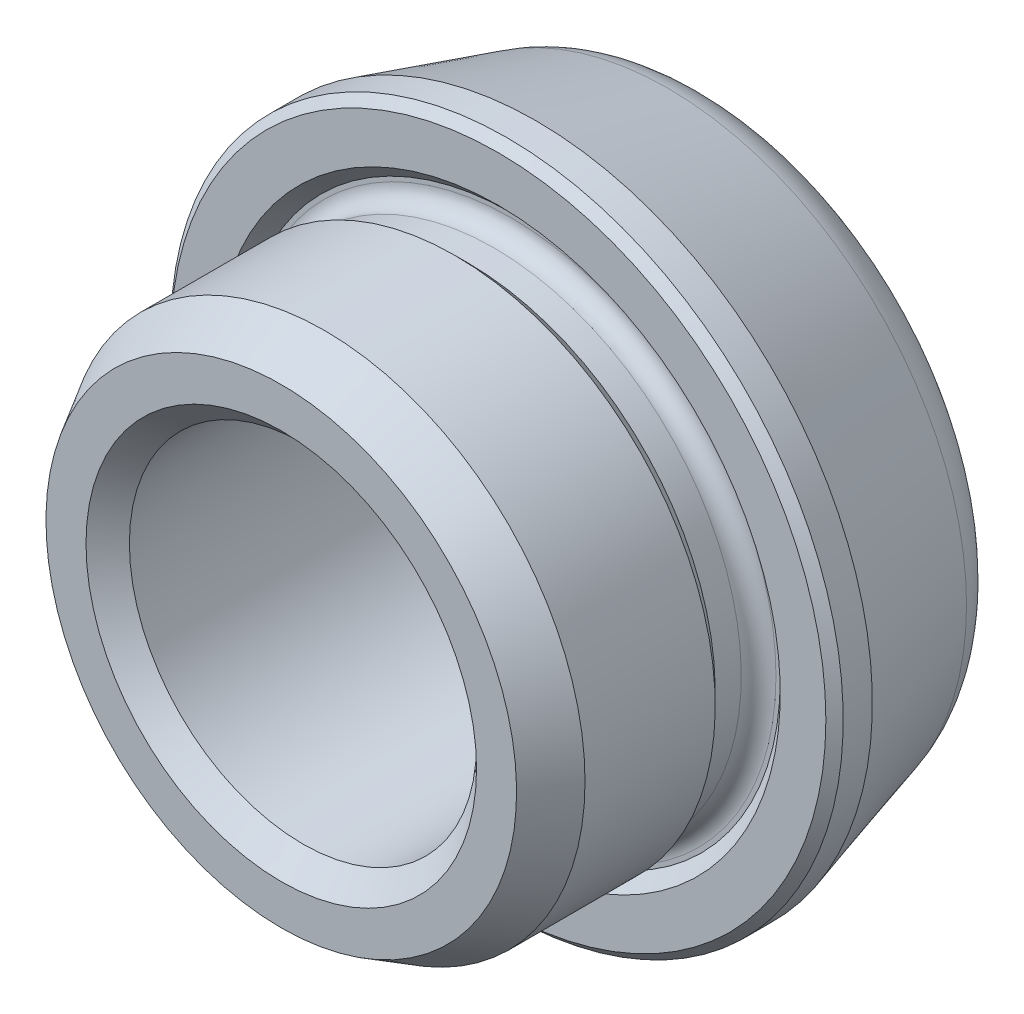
ISO-10303-21;
HEADER;
FILE_DESCRIPTION(('STEP AP214'),'2;1');
FILE_NAME('part.step','',(''),(''),'','','');
FILE_SCHEMA(('AUTOMOTIVE_DESIGN { 1 0 10303 214 1 1 1 1 }'));
ENDSEC;
DATA;
#1=APPLICATION_CONTEXT('core data for automotive mechanical design processes');
#2=APPLICATION_PROTOCOL_DEFINITION('international standard','automotive_design',2000,#1);
#3=PRODUCT_CONTEXT('',#1,'mechanical');
#4=PRODUCT('Part','Part','',(#3));
#5=PRODUCT_RELATED_PRODUCT_CATEGORY('part','',(#4));
#6=PRODUCT_DEFINITION_FORMATION('','',#4);
#7=PRODUCT_DEFINITION_CONTEXT('part definition',#1,'design');
#8=PRODUCT_DEFINITION('design','',#6,#7);
#9=PRODUCT_DEFINITION_SHAPE('','',#8);
#10=(LENGTH_UNIT() NAMED_UNIT(*) SI_UNIT(.MILLI.,.METRE.));
#11=(NAMED_UNIT(*) PLANE_ANGLE_UNIT() SI_UNIT($,.RADIAN.));
#12=(NAMED_UNIT(*) SI_UNIT($,.STERADIAN.) SOLID_ANGLE_UNIT());
#13=UNCERTAINTY_MEASURE_WITH_UNIT(LENGTH_MEASURE(1.E-05),#10,'distance_accuracy_value','');
#14=(GEOMETRIC_REPRESENTATION_CONTEXT(3) GLOBAL_UNCERTAINTY_ASSIGNED_CONTEXT((#13)) GLOBAL_UNIT_ASSIGNED_CONTEXT((#10,
#11,#12)) REPRESENTATION_CONTEXT('',''));
#15=CARTESIAN_POINT('',(0.,0.,0.));
#16=DIRECTION('',(0.,0.,1.));
#17=DIRECTION('',(1.,0.,0.));
#18=AXIS2_PLACEMENT_3D('',#15,#16,#17);
#19=CARTESIAN_POINT('',(0.,0.,0.));
#20=DIRECTION('',(0.,0.,-1.));
#21=DIRECTION('',(0.,1.,0.));
#22=AXIS2_PLACEMENT_3D('',#19,#20,#21);
#23=CYLINDRICAL_SURFACE('',#22,6.);
#24=CARTESIAN_POINT('',(0.,0.,1.));
#25=DIRECTION('',(0.,0.,-1.));
#26=DIRECTION('',(0.,1.,0.));
#27=AXIS2_PLACEMENT_3D('',#24,#25,#26);
#28=CIRCLE('',#27,6.);
#29=CARTESIAN_POINT('',(0.,6.,1.));
#30=VERTEX_POINT('',#29);
#31=EDGE_CURVE('E62',#30,#30,#28,.T.);
#32=ORIENTED_EDGE('',*,*,#31,.F.);
#33=EDGE_LOOP('',(#32));
#34=FACE_BOUND('',#33,.T.);
#35=CARTESIAN_POINT('',(0.,0.,4.));
#36=DIRECTION('',(0.,0.,1.));
#37=DIRECTION('',(0.,-1.,0.));
#38=AXIS2_PLACEMENT_3D('',#35,#36,#37);
#39=CIRCLE('',#38,6.);
#40=CARTESIAN_POINT('',(0.,-6.,4.));
#41=VERTEX_POINT('',#40);
#42=EDGE_CURVE('E47',#41,#41,#39,.F.);
#43=ORIENTED_EDGE('',*,*,#42,.T.);
#44=EDGE_LOOP('',(#43));
#45=FACE_BOUND('',#44,.T.);
#46=ADVANCED_FACE('F12',(#34,#45),#23,.T.);
#47=CARTESIAN_POINT('',(6.,0.,0.));
#48=DIRECTION('',(0.,0.,1.));
#49=DIRECTION('',(0.,-1.,0.));
#50=AXIS2_PLACEMENT_3D('',#47,#48,#49);
#51=PLANE('',#50);
#52=CARTESIAN_POINT('',(0.,0.,0.));
#53=DIRECTION('',(0.,0.,-1.));
#54=DIRECTION('',(0.,1.,0.));
#55=AXIS2_PLACEMENT_3D('',#52,#53,#54);
#56=CIRCLE('',#55,6.5);
#57=CARTESIAN_POINT('',(0.,6.5,0.));
#58=VERTEX_POINT('',#57);
#59=EDGE_CURVE('E59',#58,#58,#56,.T.);
#60=ORIENTED_EDGE('',*,*,#59,.T.);
#61=EDGE_LOOP('',(#60));
#62=FACE_BOUND('',#61,.T.);
#63=CARTESIAN_POINT('',(0.,0.,0.));
#64=DIRECTION('',(0.,0.,1.));
#65=DIRECTION('',(0.,-1.,0.));
#66=AXIS2_PLACEMENT_3D('',#63,#64,#65);
#67=CIRCLE('',#66,7.55);
#68=CARTESIAN_POINT('',(0.,-7.55,0.));
#69=VERTEX_POINT('',#68);
#70=EDGE_CURVE('E23',#69,#69,#67,.T.);
#71=ORIENTED_EDGE('',*,*,#70,.T.);
#72=EDGE_LOOP('',(#71));
#73=FACE_BOUND('',#72,.T.);
#74=ADVANCED_FACE('F87',(#62,#73),#51,.T.);
#75=CARTESIAN_POINT('',(0.,0.,0.));
#76=DIRECTION('',(0.,0.,-1.));
#77=DIRECTION('',(0.,1.,0.));
#78=AXIS2_PLACEMENT_3D('',#75,#76,#77);
#79=CYLINDRICAL_SURFACE('',#78,7.75);
#80=CARTESIAN_POINT('',(0.,0.,-0.199999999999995));
#81=DIRECTION('',(0.,0.,1.));
#82=DIRECTION('',(0.,-1.,0.));
#83=AXIS2_PLACEMENT_3D('',#80,#81,#82);
#84=CIRCLE('',#83,7.75);
#85=CARTESIAN_POINT('',(0.,-7.75,-0.199999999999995));
#86=VERTEX_POINT('',#85);
#87=EDGE_CURVE('E27',#86,#86,#84,.F.);
#88=ORIENTED_EDGE('',*,*,#87,.T.);
#89=EDGE_LOOP('',(#88));
#90=FACE_BOUND('',#89,.T.);
#91=CARTESIAN_POINT('',(0.,0.,-0.871853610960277));
#92=DIRECTION('',(0.,0.,-1.));
#93=DIRECTION('',(0.,1.,0.));
#94=AXIS2_PLACEMENT_3D('',#91,#92,#93);
#95=CIRCLE('',#94,7.75);
#96=CARTESIAN_POINT('',(0.,7.75,-0.871853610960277));
#97=VERTEX_POINT('',#96);
#98=EDGE_CURVE('E56',#97,#97,#95,.T.);
#99=ORIENTED_EDGE('',*,*,#98,.F.);
#100=EDGE_LOOP('',(#99));
#101=FACE_BOUND('',#100,.T.);
#102=ADVANCED_FACE('F93',(#90,#101),#79,.T.);
#103=CARTESIAN_POINT('',(0.,0.,-5.));
#104=DIRECTION('',(0.,0.,1.));
#105=DIRECTION('',(0.,-1.,0.));
#106=AXIS2_PLACEMENT_3D('',#103,#104,#105);
#107=CONICAL_SURFACE('',#106,6.56627307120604,0.279252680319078);
#108=CARTESIAN_POINT('',(0.,0.,-3.91345603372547));
#109=DIRECTION('',(0.,0.,-1.));
#110=DIRECTION('',(0.,1.,0.));
#111=AXIS2_PLACEMENT_3D('',#108,#109,#110);
#112=CIRCLE('',#111,6.87783453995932);
#113=CARTESIAN_POINT('',(0.,6.87783453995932,-3.91345603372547));
#114=VERTEX_POINT('',#113);
#115=EDGE_CURVE('E50',#114,#114,#112,.F.);
#116=ORIENTED_EDGE('',*,*,#115,.T.);
#117=EDGE_LOOP('',(#116));
#118=FACE_BOUND('',#117,.T.);
#119=ORIENTED_EDGE('',*,*,#98,.T.);
#120=EDGE_LOOP('',(#119));
#121=FACE_BOUND('',#120,.T.);
#122=ADVANCED_FACE('F130',(#118,#121),#107,.T.);
#123=CARTESIAN_POINT('',(4.,0.,-5.));
#124=DIRECTION('',(0.,0.,-1.));
#125=DIRECTION('',(0.,1.,0.));
#126=AXIS2_PLACEMENT_3D('',#123,#124,#125);
#127=PLANE('',#126);
#128=CARTESIAN_POINT('',(0.,0.,-5.));
#129=DIRECTION('',(0.,0.,-1.));
#130=DIRECTION('',(0.,1.,0.));
#131=AXIS2_PLACEMENT_3D('',#128,#129,#130);
#132=CIRCLE('',#131,4.5);
#133=CARTESIAN_POINT('',(0.,4.5,-5.));
#134=VERTEX_POINT('',#133);
#135=EDGE_CURVE('E38',#134,#134,#132,.F.);
#136=ORIENTED_EDGE('',*,*,#135,.T.);
#137=EDGE_LOOP('',(#136));
#138=FACE_BOUND('',#137,.T.);
#139=CARTESIAN_POINT('',(0.,0.,-5.));
#140=DIRECTION('',(0.,0.,-1.));
#141=DIRECTION('',(0.,1.,0.));
#142=AXIS2_PLACEMENT_3D('',#139,#140,#141);
#143=CIRCLE('',#142,5.43594199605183);
#144=CARTESIAN_POINT('',(0.,5.43594199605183,-5.));
#145=VERTEX_POINT('',#144);
#146=EDGE_CURVE('E53',#145,#145,#143,.T.);
#147=ORIENTED_EDGE('',*,*,#146,.T.);
#148=EDGE_LOOP('',(#147));
#149=FACE_BOUND('',#148,.T.);
#150=ADVANCED_FACE('F134',(#138,#149),#127,.T.);
#151=CARTESIAN_POINT('',(0.,0.,0.));
#152=DIRECTION('',(0.,0.,-1.));
#153=DIRECTION('',(0.,1.,0.));
#154=AXIS2_PLACEMENT_3D('',#151,#152,#153);
#155=CYLINDRICAL_SURFACE('',#154,4.);
#156=CARTESIAN_POINT('',(0.,0.,-4.5));
#157=DIRECTION('',(0.,0.,-1.));
#158=DIRECTION('',(0.,1.,0.));
#159=AXIS2_PLACEMENT_3D('',#156,#157,#158);
#160=CIRCLE('',#159,4.);
#161=CARTESIAN_POINT('',(0.,4.,-4.5));
#162=VERTEX_POINT('',#161);
#163=EDGE_CURVE('E41',#162,#162,#160,.T.);
#164=ORIENTED_EDGE('',*,*,#163,.T.);
#165=EDGE_LOOP('',(#164));
#166=FACE_BOUND('',#165,.T.);
#167=CARTESIAN_POINT('',(0.,0.,4.5));
#168=DIRECTION('',(0.,0.,1.));
#169=DIRECTION('',(0.,-1.,0.));
#170=AXIS2_PLACEMENT_3D('',#167,#168,#169);
#171=CIRCLE('',#170,4.);
#172=CARTESIAN_POINT('',(0.,-4.,4.5));
#173=VERTEX_POINT('',#172);
#174=EDGE_CURVE('E32',#173,#173,#171,.T.);
#175=ORIENTED_EDGE('',*,*,#174,.T.);
#176=EDGE_LOOP('',(#175));
#177=FACE_BOUND('',#176,.T.);
#178=ADVANCED_FACE('F140',(#166,#177),#155,.F.);
#179=CARTESIAN_POINT('',(4.,0.,5.));
#180=DIRECTION('',(0.,0.,1.));
#181=DIRECTION('',(0.,-1.,0.));
#182=AXIS2_PLACEMENT_3D('',#179,#180,#181);
#183=PLANE('',#182);
#184=CARTESIAN_POINT('',(0.,0.,5.));
#185=DIRECTION('',(0.,0.,1.));
#186=DIRECTION('',(0.,-1.,0.));
#187=AXIS2_PLACEMENT_3D('',#184,#185,#186);
#188=CIRCLE('',#187,4.5);
#189=CARTESIAN_POINT('',(0.,-4.5,5.));
#190=VERTEX_POINT('',#189);
#191=EDGE_CURVE('E35',#190,#190,#188,.F.);
#192=ORIENTED_EDGE('',*,*,#191,.T.);
#193=EDGE_LOOP('',(#192));
#194=FACE_BOUND('',#193,.T.);
#195=CARTESIAN_POINT('',(0.,0.,5.));
#196=DIRECTION('',(0.,0.,1.));
#197=DIRECTION('',(0.,-1.,0.));
#198=AXIS2_PLACEMENT_3D('',#195,#196,#197);
#199=CIRCLE('',#198,5.42264973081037);
#200=CARTESIAN_POINT('',(0.,-5.42264973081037,5.));
#201=VERTEX_POINT('',#200);
#202=EDGE_CURVE('E44',#201,#201,#199,.T.);
#203=ORIENTED_EDGE('',*,*,#202,.T.);
#204=EDGE_LOOP('',(#203));
#205=FACE_BOUND('',#204,.T.);
#206=ADVANCED_FACE('F104',(#194,#205),#183,.T.);
#207=CARTESIAN_POINT('',(0.,0.,-3.5));
#208=DIRECTION('',(0.,0.,-1.));
#209=DIRECTION('',(0.,1.,0.));
#210=AXIS2_PLACEMENT_3D('',#207,#208,#209);
#211=TOROIDAL_SURFACE('',#210,5.43594199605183,1.5);
#212=ORIENTED_EDGE('',*,*,#115,.F.);
#213=EDGE_LOOP('',(#212));
#214=FACE_BOUND('',#213,.T.);
#215=ORIENTED_EDGE('',*,*,#146,.F.);
#216=EDGE_LOOP('',(#215));
#217=FACE_BOUND('',#216,.T.);
#218=ADVANCED_FACE('F100',(#214,#217),#211,.T.);
#219=CARTESIAN_POINT('',(0.,0.,4.));
#220=DIRECTION('',(0.,0.,-1.));
#221=DIRECTION('',(0.,1.,0.));
#222=AXIS2_PLACEMENT_3D('',#219,#220,#221);
#223=CONICAL_SURFACE('',#222,6.,0.523598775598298);
#224=ORIENTED_EDGE('',*,*,#202,.F.);
#225=EDGE_LOOP('',(#224));
#226=FACE_BOUND('',#225,.T.);
#227=ORIENTED_EDGE('',*,*,#42,.F.);
#228=EDGE_LOOP('',(#227));
#229=FACE_BOUND('',#228,.T.);
#230=ADVANCED_FACE('F103',(#226,#229),#223,.T.);
#231=CARTESIAN_POINT('',(0.,0.,-4.5));
#232=DIRECTION('',(0.,0.,-1.));
#233=DIRECTION('',(0.,1.,0.));
#234=AXIS2_PLACEMENT_3D('',#231,#232,#233);
#235=CONICAL_SURFACE('',#234,4.,0.785398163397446);
#236=ORIENTED_EDGE('',*,*,#135,.F.);
#237=EDGE_LOOP('',(#236));
#238=FACE_BOUND('',#237,.T.);
#239=ORIENTED_EDGE('',*,*,#163,.F.);
#240=EDGE_LOOP('',(#239));
#241=FACE_BOUND('',#240,.T.);
#242=ADVANCED_FACE('F108',(#238,#241),#235,.F.);
#243=CARTESIAN_POINT('',(0.,0.,5.));
#244=DIRECTION('',(0.,0.,1.));
#245=DIRECTION('',(0.,-1.,0.));
#246=AXIS2_PLACEMENT_3D('',#243,#244,#245);
#247=CONICAL_SURFACE('',#246,4.5,0.785398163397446);
#248=ORIENTED_EDGE('',*,*,#174,.F.);
#249=EDGE_LOOP('',(#248));
#250=FACE_BOUND('',#249,.T.);
#251=ORIENTED_EDGE('',*,*,#191,.F.);
#252=EDGE_LOOP('',(#251));
#253=FACE_BOUND('',#252,.T.);
#254=ADVANCED_FACE('F112',(#250,#253),#247,.F.);
#255=CARTESIAN_POINT('',(0.,0.,-0.199999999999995));
#256=DIRECTION('',(0.,0.,-1.));
#257=DIRECTION('',(0.,1.,0.));
#258=AXIS2_PLACEMENT_3D('',#255,#256,#257);
#259=CONICAL_SURFACE('',#258,7.75,0.78539816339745);
#260=ORIENTED_EDGE('',*,*,#70,.F.);
#261=EDGE_LOOP('',(#260));
#262=FACE_BOUND('',#261,.T.);
#263=ORIENTED_EDGE('',*,*,#87,.F.);
#264=EDGE_LOOP('',(#263));
#265=FACE_BOUND('',#264,.T.);
#266=ADVANCED_FACE('F115',(#262,#265),#259,.T.);
#267=CARTESIAN_POINT('',(0.,0.,-0.3));
#268=DIRECTION('',(0.,0.,1.));
#269=DIRECTION('',(0.,-1.,0.));
#270=AXIS2_PLACEMENT_3D('',#267,#268,#269);
#271=CONICAL_SURFACE('',#270,6.2,0.785398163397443);
#272=ORIENTED_EDGE('',*,*,#59,.F.);
#273=EDGE_LOOP('',(#272));
#274=FACE_BOUND('',#273,.T.);
#275=CARTESIAN_POINT('',(0.,0.,-0.3));
#276=DIRECTION('',(0.,0.,-1.));
#277=DIRECTION('',(0.,1.,0.));
#278=AXIS2_PLACEMENT_3D('',#275,#276,#277);
#279=CIRCLE('',#278,6.2);
#280=CARTESIAN_POINT('',(0.,6.2,-0.3));
#281=VERTEX_POINT('',#280);
#282=EDGE_CURVE('E68',#281,#281,#279,.T.);
#283=ORIENTED_EDGE('',*,*,#282,.T.);
#284=EDGE_LOOP('',(#283));
#285=FACE_BOUND('',#284,.T.);
#286=ADVANCED_FACE('F72',(#274,#285),#271,.F.);
#287=CARTESIAN_POINT('',(0.,0.,1.));
#288=DIRECTION('',(0.,0.,1.));
#289=DIRECTION('',(0.,-1.,0.));
#290=AXIS2_PLACEMENT_3D('',#287,#288,#289);
#291=CONICAL_SURFACE('',#290,6.,0.785398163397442);
#292=CARTESIAN_POINT('',(0.,0.,0.7));
#293=DIRECTION('',(0.,0.,-1.));
#294=DIRECTION('',(0.,1.,0.));
#295=AXIS2_PLACEMENT_3D('',#292,#293,#294);
#296=CIRCLE('',#295,5.7);
#297=CARTESIAN_POINT('',(0.,5.7,0.7));
#298=VERTEX_POINT('',#297);
#299=EDGE_CURVE('E65',#298,#298,#296,.T.);
#300=ORIENTED_EDGE('',*,*,#299,.F.);
#301=EDGE_LOOP('',(#300));
#302=FACE_BOUND('',#301,.T.);
#303=ORIENTED_EDGE('',*,*,#31,.T.);
#304=EDGE_LOOP('',(#303));
#305=FACE_BOUND('',#304,.T.);
#306=ADVANCED_FACE('F84',(#302,#305),#291,.T.);
#307=CARTESIAN_POINT('',(0.,0.,0.));
#308=DIRECTION('',(0.,0.,-1.));
#309=DIRECTION('',(0.,1.,0.));
#310=AXIS2_PLACEMENT_3D('',#307,#308,#309);
#311=CYLINDRICAL_SURFACE('',#310,5.7);
#312=CARTESIAN_POINT('',(0.,0.,0.1));
#313=DIRECTION('',(0.,0.,-1.));
#314=DIRECTION('',(0.,1.,0.));
#315=AXIS2_PLACEMENT_3D('',#312,#313,#314);
#316=CIRCLE('',#315,5.7);
#317=CARTESIAN_POINT('',(0.,5.7,0.1));
#318=VERTEX_POINT('',#317);
#319=EDGE_CURVE('E8',#318,#318,#316,.F.);
#320=ORIENTED_EDGE('',*,*,#319,.T.);
#321=EDGE_LOOP('',(#320));
#322=FACE_BOUND('',#321,.T.);
#323=ORIENTED_EDGE('',*,*,#299,.T.);
#324=EDGE_LOOP('',(#323));
#325=FACE_BOUND('',#324,.T.);
#326=ADVANCED_FACE('F76',(#322,#325),#311,.T.);
#327=CARTESIAN_POINT('',(6.2,0.,-0.3));
#328=DIRECTION('',(0.,0.,-1.));
#329=DIRECTION('',(0.,1.,0.));
#330=AXIS2_PLACEMENT_3D('',#327,#328,#329);
#331=PLANE('',#330);
#332=CARTESIAN_POINT('',(0.,0.,-0.3));
#333=DIRECTION('',(0.,0.,-1.));
#334=DIRECTION('',(0.,1.,0.));
#335=AXIS2_PLACEMENT_3D('',#332,#333,#334);
#336=CIRCLE('',#335,6.1);
#337=CARTESIAN_POINT('',(0.,6.1,-0.3));
#338=VERTEX_POINT('',#337);
#339=EDGE_CURVE('E19',#338,#338,#336,.T.);
#340=ORIENTED_EDGE('',*,*,#339,.T.);
#341=EDGE_LOOP('',(#340));
#342=FACE_BOUND('',#341,.T.);
#343=ORIENTED_EDGE('',*,*,#282,.F.);
#344=EDGE_LOOP('',(#343));
#345=FACE_BOUND('',#344,.T.);
#346=ADVANCED_FACE('F74',(#342,#345),#331,.F.);
#347=CARTESIAN_POINT('',(0.,0.,0.1));
#348=DIRECTION('',(0.,0.,-1.));
#349=DIRECTION('',(0.,1.,0.));
#350=AXIS2_PLACEMENT_3D('',#347,#348,#349);
#351=TOROIDAL_SURFACE('',#350,6.1,0.4);
#352=ORIENTED_EDGE('',*,*,#319,.F.);
#353=EDGE_LOOP('',(#352));
#354=FACE_BOUND('',#353,.T.);
#355=ORIENTED_EDGE('',*,*,#339,.F.);
#356=EDGE_LOOP('',(#355));
#357=FACE_BOUND('',#356,.T.);
#358=ADVANCED_FACE('F14',(#354,#357),#351,.F.);
#359=CLOSED_SHELL('',(#46,#74,#102,#122,#150,#178,#206,#218,#230,#242,#254,#266,#286,#306,#326,
#346,#358));
#360=MANIFOLD_SOLID_BREP('B1',#359);
#361=ADVANCED_BREP_SHAPE_REPRESENTATION('',(#18,#360),#14);
#362=SHAPE_DEFINITION_REPRESENTATION(#9,#361);
ENDSEC;
END-ISO-10303-21;
